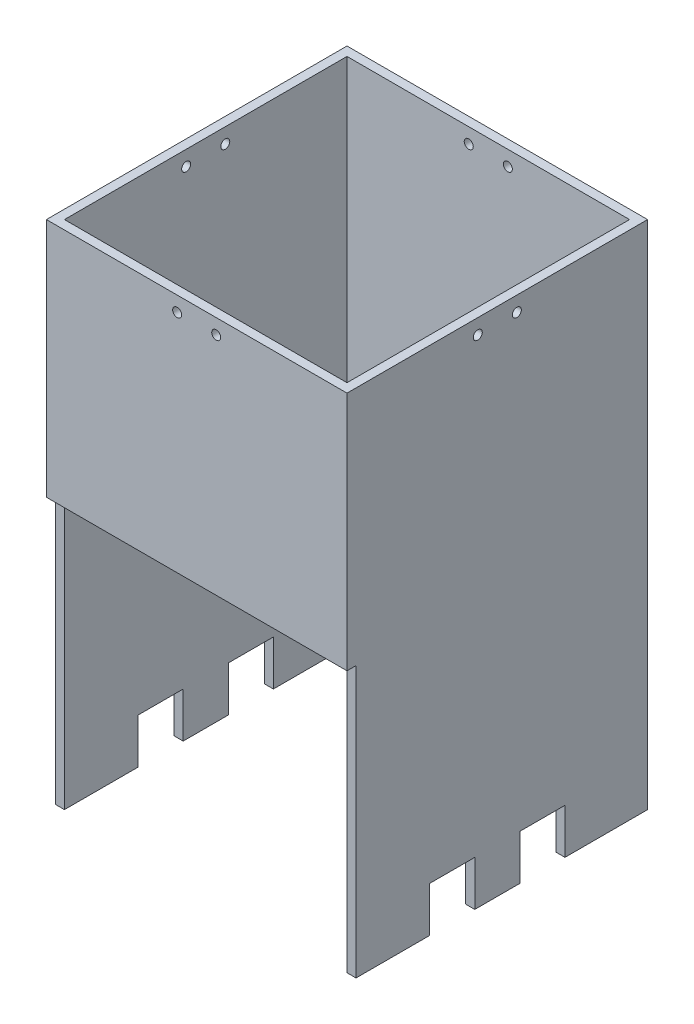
from build123d import *

# Parameters (mm, degrees)
SKETCH_1_W          = 100
SKETCH_1_H          = 100
SKETCH_1_W_2        = 94
SKETCH_1_H_2        = 94
EXTRUDE_1_DEPTH     = 170
CUT_EXTRUDE_1_REACH = 205.47
SKETCH_2_R          = 1.5
CUT_EXTRUDE_2_REACH = 205.47
SKETCH_3_R          = 1.5
CUT_EXTRUDE_3_REACH = 205.47
SKETCH_4_W          = 15
SKETCH_4_H          = 15
CUT_EXTRUDE_4_REACH = 205.47
SKETCH_5_W          = 3
SKETCH_5_H          = 90


with BuildPart() as part:
    # Sketch 1 → Extrude 1 (new body)
    with BuildSketch(Plane(origin=(0, 0, 0), x_dir=(1, 0, 0), z_dir=(0, 1, 0))):
        Rectangle(SKETCH_1_W, SKETCH_1_H)
        Rectangle(SKETCH_1_W_2, SKETCH_1_H_2, mode=Mode.SUBTRACT)
    extrude(amount=EXTRUDE_1_DEPTH)

    # Cut-Extrude 1: up to this face of the body (flat: up to its plane)
    cut_extrude_1_end = Plane(part.part.faces().sort_by_distance((0, 85, -50))[0])
    # Sketch 2 → Cut-Extrude 1 (cut, up to the picked face)
    with BuildSketch(Plane.XY.offset(50), mode=Mode.PRIVATE) as cut_extrude_1_sk1:
        with Locations((6.5, 165)):
            Circle(SKETCH_2_R)
    cut_extrude_1_tool1 = split(extrude(cut_extrude_1_sk1.sketch, amount=-CUT_EXTRUDE_1_REACH, mode=Mode.PRIVATE), bisect_by=cut_extrude_1_end, keep=Keep.BOTH, mode=Mode.PRIVATE)
    # Sketch 2 → Cut-Extrude 1 (cut, up to the picked face)
    with BuildSketch(Plane.XY.offset(50), mode=Mode.PRIVATE) as cut_extrude_1_sk2:
        with Locations((-6.5, 165)):
            Circle(SKETCH_2_R)
    cut_extrude_1_tool2 = split(extrude(cut_extrude_1_sk2.sketch, amount=-CUT_EXTRUDE_1_REACH, mode=Mode.PRIVATE), bisect_by=cut_extrude_1_end, keep=Keep.BOTH, mode=Mode.PRIVATE)
    add(cut_extrude_1_tool1.solids().sort_by(Axis((6.5, 165, 50), (0, 0, -1)))[0], mode=Mode.SUBTRACT)
    add(cut_extrude_1_tool2.solids().sort_by(Axis((-6.5, 165, 50), (0, 0, -1)))[0], mode=Mode.SUBTRACT)

    # Cut-Extrude 2: up to this face of the body (flat: up to its plane)
    cut_extrude_2_end = Plane(part.part.faces().sort_by_distance((-50, 85, 0))[0])
    # Sketch 3 → Cut-Extrude 2 (cut, up to the picked face)
    with BuildSketch(Plane(origin=(50, 0, 0), x_dir=(0, 0, -1), z_dir=(1, 0, 0)), mode=Mode.PRIVATE) as cut_extrude_2_sk1:
        with Locations((6.5, 165)):
            Circle(SKETCH_3_R)
    cut_extrude_2_tool1 = split(extrude(cut_extrude_2_sk1.sketch, amount=-CUT_EXTRUDE_2_REACH, mode=Mode.PRIVATE), bisect_by=cut_extrude_2_end, keep=Keep.BOTH, mode=Mode.PRIVATE)
    # Sketch 3 → Cut-Extrude 2 (cut, up to the picked face)
    with BuildSketch(Plane(origin=(50, 0, 0), x_dir=(0, 0, -1), z_dir=(1, 0, 0)), mode=Mode.PRIVATE) as cut_extrude_2_sk2:
        with Locations((-6.5, 165)):
            Circle(SKETCH_3_R)
    cut_extrude_2_tool2 = split(extrude(cut_extrude_2_sk2.sketch, amount=-CUT_EXTRUDE_2_REACH, mode=Mode.PRIVATE), bisect_by=cut_extrude_2_end, keep=Keep.BOTH, mode=Mode.PRIVATE)
    add(cut_extrude_2_tool1.solids().sort_by(Axis((50, 165, -6.5), (-1, 0, 0)))[0], mode=Mode.SUBTRACT)
    add(cut_extrude_2_tool2.solids().sort_by(Axis((50, 165, 6.5), (-1, 0, 0)))[0], mode=Mode.SUBTRACT)

    # Cut-Extrude 3: up to this face of the body (flat: up to its plane)
    cut_extrude_3_end = Plane(part.part.faces().sort_by_distance((-50, 84.933416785, 0))[0])
    # Sketch 4 → Cut-Extrude 3 (cut, up to the picked face)
    with BuildSketch(Plane(origin=(50, 0, 0), x_dir=(0, 0, -1), z_dir=(1, 0, 0)), mode=Mode.PRIVATE) as cut_extrude_3_sk1:
        with Locations((15, 7.5)):
            Rectangle(SKETCH_4_W, SKETCH_4_H)
    cut_extrude_3_tool1 = split(extrude(cut_extrude_3_sk1.sketch, amount=-CUT_EXTRUDE_3_REACH, mode=Mode.PRIVATE), bisect_by=cut_extrude_3_end, keep=Keep.BOTH, mode=Mode.PRIVATE)
    # Sketch 4 → Cut-Extrude 3 (cut, up to the picked face)
    with BuildSketch(Plane(origin=(50, 0, 0), x_dir=(0, 0, -1), z_dir=(1, 0, 0)), mode=Mode.PRIVATE) as cut_extrude_3_sk2:
        with Locations((-15, 7.5)):
            Rectangle(SKETCH_4_W, SKETCH_4_H)
    cut_extrude_3_tool2 = split(extrude(cut_extrude_3_sk2.sketch, amount=-CUT_EXTRUDE_3_REACH, mode=Mode.PRIVATE), bisect_by=cut_extrude_3_end, keep=Keep.BOTH, mode=Mode.PRIVATE)
    add(cut_extrude_3_tool1.solids().sort_by(Axis((50, 7.5, -15), (-1, 0, 0)))[0], mode=Mode.SUBTRACT)
    add(cut_extrude_3_tool2.solids().sort_by(Axis((50, 7.5, 15), (-1, 0, 0)))[0], mode=Mode.SUBTRACT)

    # Cut-Extrude 4: up to this face of the body (flat: up to its plane)
    cut_extrude_4_end = Plane(part.part.faces().sort_by_distance((-50, 87.040657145, 0))[0])
    # Sketch 5 → Cut-Extrude 4 (cut, up to the picked face)
    with BuildSketch(Plane(origin=(50, 0, 0), x_dir=(0, 0, -1), z_dir=(1, 0, 0)), mode=Mode.PRIVATE) as cut_extrude_4_sk1:
        with Locations((-48.5, 45)):
            Rectangle(SKETCH_5_W, SKETCH_5_H)
    cut_extrude_4_tool1 = split(extrude(cut_extrude_4_sk1.sketch, amount=-CUT_EXTRUDE_4_REACH, mode=Mode.PRIVATE), bisect_by=cut_extrude_4_end, keep=Keep.BOTH, mode=Mode.PRIVATE)
    add(cut_extrude_4_tool1.solids().sort_by(Axis((50, 45, 48.5), (-1, 0, 0)))[0], mode=Mode.SUBTRACT)


solid = part.part
